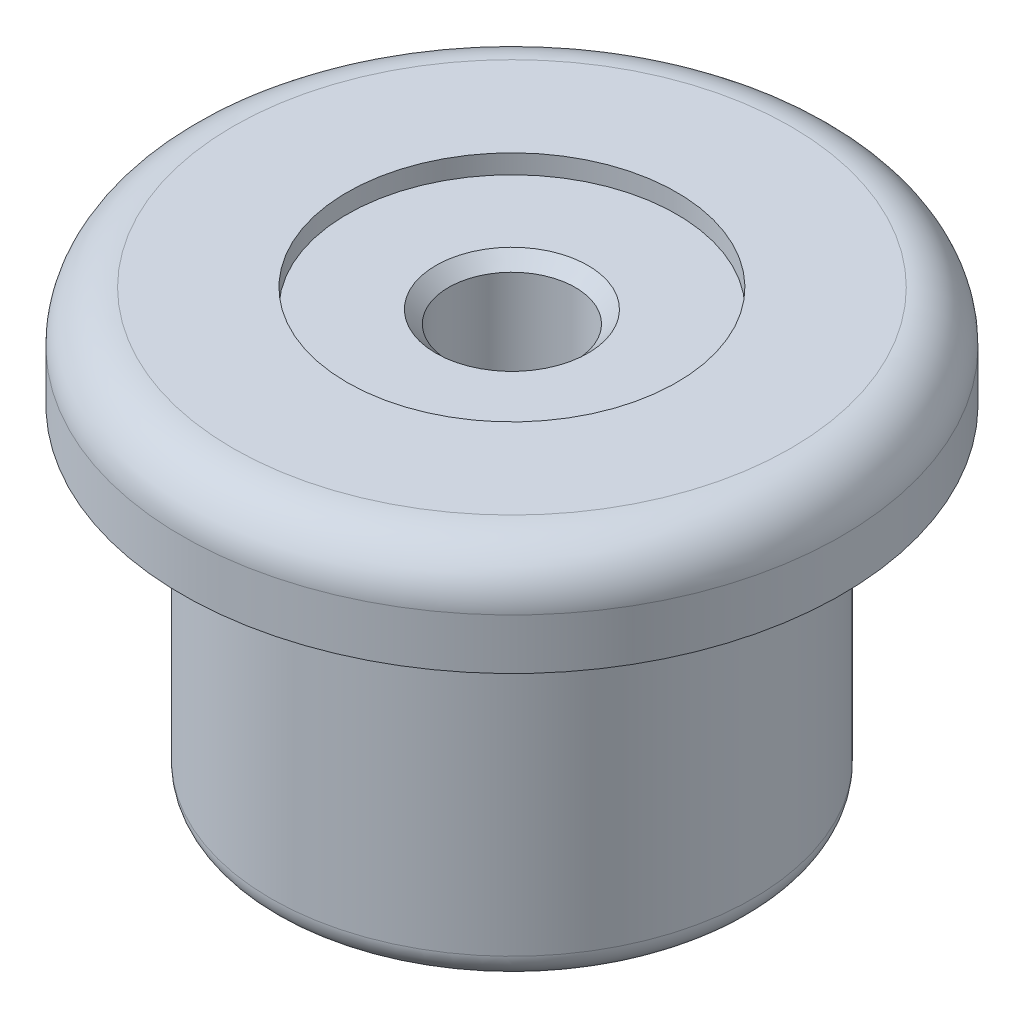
ISO-10303-21;
HEADER;
FILE_DESCRIPTION(('STEP AP214'),'2;1');
FILE_NAME('part.step','',(''),(''),'','','');
FILE_SCHEMA(('AUTOMOTIVE_DESIGN { 1 0 10303 214 1 1 1 1 }'));
ENDSEC;
DATA;
#1=APPLICATION_CONTEXT('core data for automotive mechanical design processes');
#2=APPLICATION_PROTOCOL_DEFINITION('international standard','automotive_design',2000,#1);
#3=PRODUCT_CONTEXT('',#1,'mechanical');
#4=PRODUCT('Part','Part','',(#3));
#5=PRODUCT_RELATED_PRODUCT_CATEGORY('part','',(#4));
#6=PRODUCT_DEFINITION_FORMATION('','',#4);
#7=PRODUCT_DEFINITION_CONTEXT('part definition',#1,'design');
#8=PRODUCT_DEFINITION('design','',#6,#7);
#9=PRODUCT_DEFINITION_SHAPE('','',#8);
#10=(LENGTH_UNIT() NAMED_UNIT(*) SI_UNIT(.MILLI.,.METRE.));
#11=(NAMED_UNIT(*) PLANE_ANGLE_UNIT() SI_UNIT($,.RADIAN.));
#12=(NAMED_UNIT(*) SI_UNIT($,.STERADIAN.) SOLID_ANGLE_UNIT());
#13=UNCERTAINTY_MEASURE_WITH_UNIT(LENGTH_MEASURE(1.E-05),#10,'distance_accuracy_value','');
#14=(GEOMETRIC_REPRESENTATION_CONTEXT(3) GLOBAL_UNCERTAINTY_ASSIGNED_CONTEXT((#13)) GLOBAL_UNIT_ASSIGNED_CONTEXT((#10,
#11,#12)) REPRESENTATION_CONTEXT('',''));
#15=CARTESIAN_POINT('',(0.,0.,0.));
#16=DIRECTION('',(0.,0.,1.));
#17=DIRECTION('',(1.,0.,0.));
#18=AXIS2_PLACEMENT_3D('',#15,#16,#17);
#19=CARTESIAN_POINT('',(0.,1.4,0.));
#20=DIRECTION('',(0.,-1.,0.));
#21=DIRECTION('',(1.,0.,0.));
#22=AXIS2_PLACEMENT_3D('',#19,#20,#21);
#23=SPHERICAL_SURFACE('',#22,9.);
#24=CARTESIAN_POINT('',(0.,1.4,0.));
#25=DIRECTION('',(0.,-1.,0.));
#26=DIRECTION('',(0.,0.,-1.));
#27=AXIS2_PLACEMENT_3D('',#24,#25,#26);
#28=CIRCLE('',#27,9.);
#29=CARTESIAN_POINT('',(0.,1.4,-9.));
#30=VERTEX_POINT('',#29);
#31=EDGE_CURVE('E74',#30,#30,#28,.T.);
#32=ORIENTED_EDGE('',*,*,#31,.T.);
#33=EDGE_LOOP('',(#32));
#34=FACE_BOUND('',#33,.T.);
#35=CARTESIAN_POINT('',(0.,9.88528137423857,0.));
#36=DIRECTION('',(0.,-1.,0.));
#37=DIRECTION('',(0.,0.,-1.));
#38=AXIS2_PLACEMENT_3D('',#35,#36,#37);
#39=CIRCLE('',#38,3.);
#40=CARTESIAN_POINT('',(0.,9.88528137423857,-3.));
#41=VERTEX_POINT('',#40);
#42=EDGE_CURVE('E55',#41,#41,#39,.F.);
#43=ORIENTED_EDGE('',*,*,#42,.T.);
#44=EDGE_LOOP('',(#43));
#45=FACE_BOUND('',#44,.T.);
#46=ADVANCED_FACE('F34',(#34,#45),#23,.F.);
#47=CARTESIAN_POINT('',(11.,17.,0.));
#48=DIRECTION('',(0.,1.,0.));
#49=DIRECTION('',(0.,0.,1.));
#50=AXIS2_PLACEMENT_3D('',#47,#48,#49);
#51=PLANE('',#50);
#52=CARTESIAN_POINT('',(0.,17.,0.));
#53=DIRECTION('',(0.,1.,0.));
#54=DIRECTION('',(0.,0.,1.));
#55=AXIS2_PLACEMENT_3D('',#52,#53,#54);
#56=CIRCLE('',#55,6.5);
#57=CARTESIAN_POINT('',(0.,17.,6.5));
#58=VERTEX_POINT('',#57);
#59=EDGE_CURVE('E58',#58,#58,#56,.T.);
#60=ORIENTED_EDGE('',*,*,#59,.F.);
#61=EDGE_LOOP('',(#60));
#62=FACE_BOUND('',#61,.T.);
#63=CARTESIAN_POINT('',(0.,17.,0.));
#64=DIRECTION('',(0.,-1.,0.));
#65=DIRECTION('',(0.,0.,-1.));
#66=AXIS2_PLACEMENT_3D('',#63,#64,#65);
#67=CIRCLE('',#66,11.);
#68=CARTESIAN_POINT('',(0.,17.,-11.));
#69=VERTEX_POINT('',#68);
#70=EDGE_CURVE('E54',#69,#69,#67,.T.);
#71=ORIENTED_EDGE('',*,*,#70,.F.);
#72=EDGE_LOOP('',(#71));
#73=FACE_BOUND('',#72,.T.);
#74=ADVANCED_FACE('F106',(#62,#73),#51,.T.);
#75=CARTESIAN_POINT('',(0.,15.,0.));
#76=DIRECTION('',(0.,-1.,0.));
#77=DIRECTION('',(0.,0.,-1.));
#78=AXIS2_PLACEMENT_3D('',#75,#76,#77);
#79=TOROIDAL_SURFACE('',#78,11.,2.);
#80=ORIENTED_EDGE('',*,*,#70,.T.);
#81=EDGE_LOOP('',(#80));
#82=FACE_BOUND('',#81,.T.);
#83=CARTESIAN_POINT('',(0.,15.,0.));
#84=DIRECTION('',(0.,-1.,0.));
#85=DIRECTION('',(0.,0.,-1.));
#86=AXIS2_PLACEMENT_3D('',#83,#84,#85);
#87=CIRCLE('',#86,13.);
#88=CARTESIAN_POINT('',(0.,15.,-13.));
#89=VERTEX_POINT('',#88);
#90=EDGE_CURVE('E62',#89,#89,#87,.T.);
#91=ORIENTED_EDGE('',*,*,#90,.F.);
#92=EDGE_LOOP('',(#91));
#93=FACE_BOUND('',#92,.T.);
#94=ADVANCED_FACE('F112',(#82,#93),#79,.T.);
#95=CARTESIAN_POINT('',(0.,0.,0.));
#96=DIRECTION('',(0.,-1.,0.));
#97=DIRECTION('',(0.,0.,-1.));
#98=AXIS2_PLACEMENT_3D('',#95,#96,#97);
#99=CYLINDRICAL_SURFACE('',#98,13.);
#100=ORIENTED_EDGE('',*,*,#90,.T.);
#101=EDGE_LOOP('',(#100));
#102=FACE_BOUND('',#101,.T.);
#103=CARTESIAN_POINT('',(0.,13.,0.));
#104=DIRECTION('',(0.,-1.,0.));
#105=DIRECTION('',(0.,0.,-1.));
#106=AXIS2_PLACEMENT_3D('',#103,#104,#105);
#107=CIRCLE('',#106,13.);
#108=CARTESIAN_POINT('',(0.,13.,-13.));
#109=VERTEX_POINT('',#108);
#110=EDGE_CURVE('E65',#109,#109,#107,.T.);
#111=ORIENTED_EDGE('',*,*,#110,.F.);
#112=EDGE_LOOP('',(#111));
#113=FACE_BOUND('',#112,.T.);
#114=ADVANCED_FACE('F210',(#102,#113),#99,.T.);
#115=CARTESIAN_POINT('',(9.5,13.,0.));
#116=DIRECTION('',(0.,-1.,0.));
#117=DIRECTION('',(0.,0.,-1.));
#118=AXIS2_PLACEMENT_3D('',#115,#116,#117);
#119=PLANE('',#118);
#120=ORIENTED_EDGE('',*,*,#110,.T.);
#121=EDGE_LOOP('',(#120));
#122=FACE_BOUND('',#121,.T.);
#123=CARTESIAN_POINT('',(0.,13.,0.));
#124=DIRECTION('',(0.,-1.,0.));
#125=DIRECTION('',(0.,0.,-1.));
#126=AXIS2_PLACEMENT_3D('',#123,#124,#125);
#127=CIRCLE('',#126,9.5);
#128=CARTESIAN_POINT('',(0.,13.,-9.5));
#129=VERTEX_POINT('',#128);
#130=EDGE_CURVE('E68',#129,#129,#127,.T.);
#131=ORIENTED_EDGE('',*,*,#130,.F.);
#132=EDGE_LOOP('',(#131));
#133=FACE_BOUND('',#132,.T.);
#134=ADVANCED_FACE('F168',(#122,#133),#119,.T.);
#135=CARTESIAN_POINT('',(0.,0.,0.));
#136=DIRECTION('',(0.,-1.,0.));
#137=DIRECTION('',(0.,0.,-1.));
#138=AXIS2_PLACEMENT_3D('',#135,#136,#137);
#139=CYLINDRICAL_SURFACE('',#138,9.5);
#140=CARTESIAN_POINT('',(0.,0.866025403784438,0.));
#141=DIRECTION('',(0.,-1.,0.));
#142=DIRECTION('',(0.,0.,-1.));
#143=AXIS2_PLACEMENT_3D('',#140,#141,#142);
#144=CIRCLE('',#143,9.5);
#145=CARTESIAN_POINT('',(0.,0.866025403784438,-9.5));
#146=VERTEX_POINT('',#145);
#147=EDGE_CURVE('E49',#146,#146,#144,.F.);
#148=ORIENTED_EDGE('',*,*,#147,.T.);
#149=EDGE_LOOP('',(#148));
#150=FACE_BOUND('',#149,.T.);
#151=ORIENTED_EDGE('',*,*,#130,.T.);
#152=EDGE_LOOP('',(#151));
#153=FACE_BOUND('',#152,.T.);
#154=ADVANCED_FACE('F162',(#150,#153),#139,.T.);
#155=CARTESIAN_POINT('',(0.,0.,0.));
#156=DIRECTION('',(0.,-1.,0.));
#157=DIRECTION('',(0.,0.,-1.));
#158=AXIS2_PLACEMENT_3D('',#155,#156,#157);
#159=CYLINDRICAL_SURFACE('',#158,9.);
#160=CARTESIAN_POINT('',(0.,0.,0.));
#161=DIRECTION('',(0.,-1.,0.));
#162=DIRECTION('',(0.,0.,-1.));
#163=AXIS2_PLACEMENT_3D('',#160,#161,#162);
#164=CIRCLE('',#163,9.);
#165=CARTESIAN_POINT('',(0.,0.,-9.));
#166=VERTEX_POINT('',#165);
#167=EDGE_CURVE('E71',#166,#166,#164,.T.);
#168=ORIENTED_EDGE('',*,*,#167,.T.);
#169=EDGE_LOOP('',(#168));
#170=FACE_BOUND('',#169,.T.);
#171=ORIENTED_EDGE('',*,*,#31,.F.);
#172=EDGE_LOOP('',(#171));
#173=FACE_BOUND('',#172,.T.);
#174=ADVANCED_FACE('F167',(#170,#173),#159,.F.);
#175=CARTESIAN_POINT('',(0.,16.25,0.));
#176=DIRECTION('',(0.,1.,0.));
#177=DIRECTION('',(0.,0.,1.));
#178=AXIS2_PLACEMENT_3D('',#175,#176,#177);
#179=CYLINDRICAL_SURFACE('',#178,6.5);
#180=CARTESIAN_POINT('',(0.,16.25,0.));
#181=DIRECTION('',(0.,1.,0.));
#182=DIRECTION('',(0.,0.,1.));
#183=AXIS2_PLACEMENT_3D('',#180,#181,#182);
#184=CIRCLE('',#183,6.5);
#185=CARTESIAN_POINT('',(0.,16.25,6.5));
#186=VERTEX_POINT('',#185);
#187=EDGE_CURVE('E77',#186,#186,#184,.T.);
#188=ORIENTED_EDGE('',*,*,#187,.F.);
#189=EDGE_LOOP('',(#188));
#190=FACE_BOUND('',#189,.T.);
#191=ORIENTED_EDGE('',*,*,#59,.T.);
#192=EDGE_LOOP('',(#191));
#193=FACE_BOUND('',#192,.T.);
#194=ADVANCED_FACE('F103',(#190,#193),#179,.F.);
#195=CARTESIAN_POINT('',(0.,16.25,0.));
#196=DIRECTION('',(0.,1.,0.));
#197=DIRECTION('',(0.,0.,1.));
#198=AXIS2_PLACEMENT_3D('',#195,#196,#197);
#199=PLANE('',#198);
#200=CARTESIAN_POINT('',(0.,16.25,0.));
#201=DIRECTION('',(0.,1.,0.));
#202=DIRECTION('',(0.,0.,1.));
#203=AXIS2_PLACEMENT_3D('',#200,#201,#202);
#204=CIRCLE('',#203,3.);
#205=CARTESIAN_POINT('',(0.,16.25,3.));
#206=VERTEX_POINT('',#205);
#207=EDGE_CURVE('E10',#206,#206,#204,.F.);
#208=ORIENTED_EDGE('',*,*,#207,.T.);
#209=EDGE_LOOP('',(#208));
#210=FACE_BOUND('',#209,.T.);
#211=ORIENTED_EDGE('',*,*,#187,.T.);
#212=EDGE_LOOP('',(#211));
#213=FACE_BOUND('',#212,.T.);
#214=ADVANCED_FACE('F94',(#210,#213),#199,.T.);
#215=CARTESIAN_POINT('',(0.,0.,0.));
#216=DIRECTION('',(0.,1.,0.));
#217=DIRECTION('',(0.,0.,1.));
#218=AXIS2_PLACEMENT_3D('',#215,#216,#217);
#219=CYLINDRICAL_SURFACE('',#218,2.5);
#220=CARTESIAN_POINT('',(0.,15.75,0.));
#221=DIRECTION('',(0.,1.,0.));
#222=DIRECTION('',(0.,0.,1.));
#223=AXIS2_PLACEMENT_3D('',#220,#221,#222);
#224=CIRCLE('',#223,2.5);
#225=CARTESIAN_POINT('',(0.,15.75,2.5));
#226=VERTEX_POINT('',#225);
#227=EDGE_CURVE('E41',#226,#226,#224,.T.);
#228=ORIENTED_EDGE('',*,*,#227,.T.);
#229=EDGE_LOOP('',(#228));
#230=FACE_BOUND('',#229,.T.);
#231=CARTESIAN_POINT('',(0.,11.5,0.));
#232=DIRECTION('',(0.,1.,0.));
#233=DIRECTION('',(0.,0.,1.));
#234=AXIS2_PLACEMENT_3D('',#231,#232,#233);
#235=CIRCLE('',#234,2.5);
#236=CARTESIAN_POINT('',(0.,11.5,2.5));
#237=VERTEX_POINT('',#236);
#238=EDGE_CURVE('E45',#237,#237,#235,.F.);
#239=ORIENTED_EDGE('',*,*,#238,.T.);
#240=EDGE_LOOP('',(#239));
#241=FACE_BOUND('',#240,.T.);
#242=ADVANCED_FACE('F92',(#230,#241),#219,.F.);
#243=CARTESIAN_POINT('',(0.,11.,0.));
#244=DIRECTION('',(0.,-1.,0.));
#245=DIRECTION('',(0.,0.,-1.));
#246=AXIS2_PLACEMENT_3D('',#243,#244,#245);
#247=CYLINDRICAL_SURFACE('',#246,3.);
#248=ORIENTED_EDGE('',*,*,#42,.F.);
#249=EDGE_LOOP('',(#248));
#250=FACE_BOUND('',#249,.T.);
#251=CARTESIAN_POINT('',(0.,11.,0.));
#252=DIRECTION('',(0.,1.,0.));
#253=DIRECTION('',(0.,0.,1.));
#254=AXIS2_PLACEMENT_3D('',#251,#252,#253);
#255=CIRCLE('',#254,3.);
#256=CARTESIAN_POINT('',(0.,11.,3.));
#257=VERTEX_POINT('',#256);
#258=EDGE_CURVE('E59',#257,#257,#255,.T.);
#259=ORIENTED_EDGE('',*,*,#258,.T.);
#260=EDGE_LOOP('',(#259));
#261=FACE_BOUND('',#260,.T.);
#262=ADVANCED_FACE('F85',(#250,#261),#247,.F.);
#263=CARTESIAN_POINT('',(0.,0.866025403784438,0.));
#264=DIRECTION('',(0.,-1.,0.));
#265=DIRECTION('',(0.,0.,-1.));
#266=AXIS2_PLACEMENT_3D('',#263,#264,#265);
#267=TOROIDAL_SURFACE('',#266,8.5,1.);
#268=ORIENTED_EDGE('',*,*,#147,.F.);
#269=EDGE_LOOP('',(#268));
#270=FACE_BOUND('',#269,.T.);
#271=ORIENTED_EDGE('',*,*,#167,.F.);
#272=EDGE_LOOP('',(#271));
#273=FACE_BOUND('',#272,.T.);
#274=ADVANCED_FACE('F100',(#270,#273),#267,.T.);
#275=CARTESIAN_POINT('',(0.,15.75,0.));
#276=DIRECTION('',(0.,1.,0.));
#277=DIRECTION('',(0.,0.,1.));
#278=AXIS2_PLACEMENT_3D('',#275,#276,#277);
#279=CONICAL_SURFACE('',#278,2.5,0.78539816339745);
#280=ORIENTED_EDGE('',*,*,#207,.F.);
#281=EDGE_LOOP('',(#280));
#282=FACE_BOUND('',#281,.T.);
#283=ORIENTED_EDGE('',*,*,#227,.F.);
#284=EDGE_LOOP('',(#283));
#285=FACE_BOUND('',#284,.T.);
#286=ADVANCED_FACE('F89',(#282,#285),#279,.F.);
#287=CARTESIAN_POINT('',(0.,11.5,0.));
#288=DIRECTION('',(0.,-1.,0.));
#289=DIRECTION('',(0.,0.,-1.));
#290=AXIS2_PLACEMENT_3D('',#287,#288,#289);
#291=CONICAL_SURFACE('',#290,2.5,0.78539816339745);
#292=ORIENTED_EDGE('',*,*,#258,.F.);
#293=EDGE_LOOP('',(#292));
#294=FACE_BOUND('',#293,.T.);
#295=ORIENTED_EDGE('',*,*,#238,.F.);
#296=EDGE_LOOP('',(#295));
#297=FACE_BOUND('',#296,.T.);
#298=ADVANCED_FACE('F36',(#294,#297),#291,.F.);
#299=CLOSED_SHELL('',(#46,#74,#94,#114,#134,#154,#174,#194,#214,#242,#262,#274,#286,#298));
#300=MANIFOLD_SOLID_BREP('B2',#299);
#301=ADVANCED_BREP_SHAPE_REPRESENTATION('',(#18,#300),#14);
#302=SHAPE_DEFINITION_REPRESENTATION(#9,#301);
ENDSEC;
END-ISO-10303-21;
